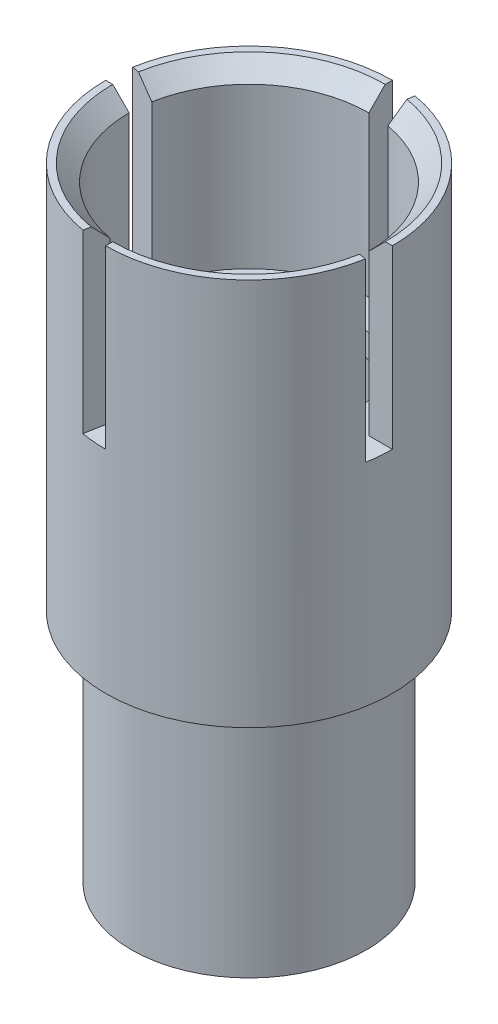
from build123d import *

# Parameters (mm, degrees)
SKETCH1_R           = 12.7
BOSS_EXTRUDE1_DEPTH = 25.4
SKETCH2_R           = 15.494
BOSS_EXTRUDE2_DEPTH = 41.91
SKETCH3_R           = 12.954
CUT_EXTRUDE1_DEPTH  = 19.05
SKETCH4_R           = 10.16
CUT_EXTRUDE2_DEPTH  = 25.4
SKETCH6_R           = 10.16
CUT_EXTRUDE3_DEPTH  = 48.292453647
CHAMFER1_SIZE       = 1.778
SKETCH7_W           = 44.387500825
SKETCH7_H           = 24.689542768
CUT_REVOLVE1_ANGLE  = 10
CIRPATTERN1_COUNT   = 4
SKETCH8_W           = 2.54
SKETCH8_H           = 17.78


with BuildPart() as part:
    # Sketch1 → Boss-Extrude1 (new body)
    with BuildSketch(Plane(origin=(0, 0, 0), x_dir=(1, 0, 0), z_dir=(0, 1, 0))):
        with Locations(Location((0, 0, 0), (0, 0, 270))):
            Circle(SKETCH1_R)
    extrude(amount=BOSS_EXTRUDE1_DEPTH)

    # Sketch2 → Boss-Extrude2 (add)
    with BuildSketch(Plane(origin=(0, 25.4, 0), x_dir=(1, 0, 0), z_dir=(0, 1, 0))):
        with Locations(Location((0, 0, 0), (0, 0, 270))):
            Circle(SKETCH2_R)
    extrude(amount=BOSS_EXTRUDE2_DEPTH)

    # Sketch3 → Cut-Extrude1 (cut)
    with BuildSketch(Plane(origin=(0, 67.31, 0), x_dir=(1, 0, 0), z_dir=(0, 1, 0))):
        with Locations(Location((0, 0, 0), (0, 0, 270))):
            Circle(SKETCH3_R)
    extrude(amount=-CUT_EXTRUDE1_DEPTH, mode=Mode.SUBTRACT)

    # Sketch4 → Cut-Extrude2 (cut)
    with BuildSketch(Plane.XZ):
        with Locations(Location((0, 0, 0), (0, 0, 270))):
            Circle(SKETCH4_R)
    extrude(amount=-CUT_EXTRUDE2_DEPTH, mode=Mode.SUBTRACT)

    # Sketch6 → Cut-Extrude3 (cut, through all)
    with BuildSketch(Plane.XZ.offset(-25.4)):
        with Locations(Location((0, 0, 0), (0, 0, 270))):
            Circle(SKETCH6_R)
    extrude(amount=-CUT_EXTRUDE3_DEPTH, mode=Mode.SUBTRACT)

    # Chamfer1
    chamfer1_edges = [part.edges().sort_by_distance(p)[0] for p in [
        (0, 67.31, -12.954),
    ]]
    chamfer(chamfer1_edges, length=CHAMFER1_SIZE)

    # Sketch7 → Cut-Revolve1 (revolve, cut)
    with BuildSketch(Plane(origin=(0, 0, 0), x_dir=(0, 0, -1), z_dir=(1, 0, 0))):
        with Locations((-35.147750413, 60.604771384)):
            Rectangle(SKETCH7_W, SKETCH7_H)
    cut_revolve1 = revolve(axis=Axis((0, 67.31, 0), (0, -1, 0)), revolution_arc=CUT_REVOLVE1_ANGLE, mode=Mode.SUBTRACT)

    # CirPattern1: Cut-Revolve1 ×4 about axis
    cirpattern1_axis = Axis((0, 25.4, 0), (0, -1, 0))
    for i in range(1, CIRPATTERN1_COUNT):
        add(cut_revolve1.rotate(cirpattern1_axis, i * 360 / CIRPATTERN1_COUNT), mode=Mode.SUBTRACT)

    # Sketch8 → Cut-Revolve2 (revolve, cut)
    with BuildSketch(Plane(origin=(0, 0, 0), x_dir=(0, 0, -1), z_dir=(1, 0, 0)), mode=Mode.PRIVATE) as cut_revolve2_sk:
        with Locations((11.43, 36.83)):
            Rectangle(SKETCH8_W, SKETCH8_H)
    revolve(cut_revolve2_sk.sketch.rotate(Axis((0, 25.4, 0), (0, -1, 0)), 180), axis=Axis((0, 25.4, 0), (0, -1, 0)), mode=Mode.SUBTRACT)


solid = part.part
